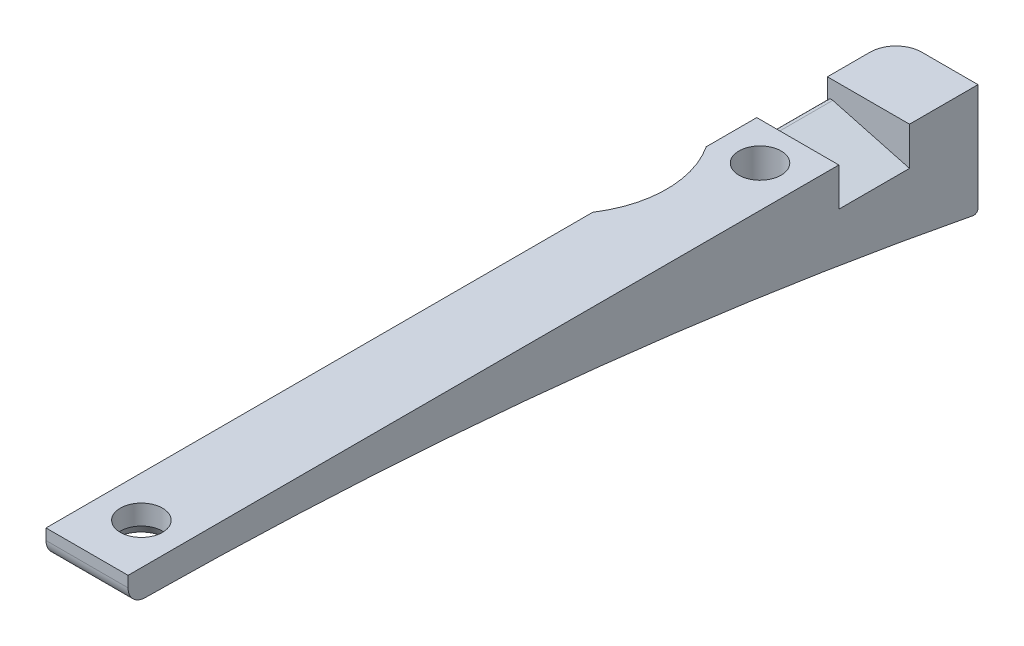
ISO-10303-21;
HEADER;
FILE_DESCRIPTION(('STEP AP214'),'2;1');
FILE_NAME('part.step','',(''),(''),'','','');
FILE_SCHEMA(('AUTOMOTIVE_DESIGN { 1 0 10303 214 1 1 1 1 }'));
ENDSEC;
DATA;
#1=APPLICATION_CONTEXT('core data for automotive mechanical design processes');
#2=APPLICATION_PROTOCOL_DEFINITION('international standard','automotive_design',2000,#1);
#3=PRODUCT_CONTEXT('',#1,'mechanical');
#4=PRODUCT('Part','Part','',(#3));
#5=PRODUCT_RELATED_PRODUCT_CATEGORY('part','',(#4));
#6=PRODUCT_DEFINITION_FORMATION('','',#4);
#7=PRODUCT_DEFINITION_CONTEXT('part definition',#1,'design');
#8=PRODUCT_DEFINITION('design','',#6,#7);
#9=PRODUCT_DEFINITION_SHAPE('','',#8);
#10=(LENGTH_UNIT() NAMED_UNIT(*) SI_UNIT(.MILLI.,.METRE.));
#11=(NAMED_UNIT(*) PLANE_ANGLE_UNIT() SI_UNIT($,.RADIAN.));
#12=(NAMED_UNIT(*) SI_UNIT($,.STERADIAN.) SOLID_ANGLE_UNIT());
#13=UNCERTAINTY_MEASURE_WITH_UNIT(LENGTH_MEASURE(1.E-05),#10,'distance_accuracy_value','');
#14=(GEOMETRIC_REPRESENTATION_CONTEXT(3) GLOBAL_UNCERTAINTY_ASSIGNED_CONTEXT((#13)) GLOBAL_UNIT_ASSIGNED_CONTEXT((#10,
#11,#12)) REPRESENTATION_CONTEXT('',''));
#15=CARTESIAN_POINT('',(0.,0.,0.));
#16=DIRECTION('',(0.,0.,1.));
#17=DIRECTION('',(1.,0.,0.));
#18=AXIS2_PLACEMENT_3D('',#15,#16,#17);
#19=CARTESIAN_POINT('',(3.8354,0.,0.));
#20=DIRECTION('',(0.,0.,1.));
#21=DIRECTION('',(0.,-1.,0.));
#22=AXIS2_PLACEMENT_3D('',#19,#20,#21);
#23=PLANE('',#22);
#24=DIRECTION('',(0.,1.,0.));
#25=VECTOR('',#24,1.);
#26=CARTESIAN_POINT('',(-1.4224,-10.3842799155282,0.));
#27=LINE('',#26,#25);
#28=CARTESIAN_POINT('',(-1.4224,-10.0032799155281,0.));
#29=VERTEX_POINT('',#28);
#30=CARTESIAN_POINT('',(-1.4224,0.,0.));
#31=VERTEX_POINT('',#30);
#32=EDGE_CURVE('E250',#29,#31,#27,.T.);
#33=ORIENTED_EDGE('',*,*,#32,.T.);
#34=DIRECTION('',(-1.,0.,0.));
#35=VECTOR('',#34,1.);
#36=CARTESIAN_POINT('',(3.8354,0.,0.));
#37=LINE('',#36,#35);
#38=CARTESIAN_POINT('',(3.8354,0.,0.));
#39=VERTEX_POINT('',#38);
#40=EDGE_CURVE('E162',#39,#31,#37,.T.);
#41=ORIENTED_EDGE('',*,*,#40,.F.);
#42=DIRECTION('',(0.,1.,0.));
#43=VECTOR('',#42,1.);
#44=CARTESIAN_POINT('',(3.8354,0.,0.));
#45=LINE('',#44,#43);
#46=CARTESIAN_POINT('',(3.8354,-10.0032799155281,0.));
#47=VERTEX_POINT('',#46);
#48=EDGE_CURVE('E153',#47,#39,#45,.T.);
#49=ORIENTED_EDGE('',*,*,#48,.F.);
#50=DIRECTION('',(-1.,0.,0.));
#51=VECTOR('',#50,1.);
#52=CARTESIAN_POINT('',(3.8354,-10.0032799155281,0.));
#53=LINE('',#52,#51);
#54=EDGE_CURVE('E165',#47,#29,#53,.T.);
#55=ORIENTED_EDGE('',*,*,#54,.T.);
#56=EDGE_LOOP('',(#33,#41,#49,#55));
#57=FACE_BOUND('',#56,.T.);
#58=ADVANCED_FACE('F34',(#57),#23,.F.);
#59=CARTESIAN_POINT('',(-3.8354,-10.0032799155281,0.380999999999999));
#60=DIRECTION('',(-1.,0.,0.));
#61=DIRECTION('',(0.,0.,1.));
#62=AXIS2_PLACEMENT_3D('',#59,#60,#61);
#63=PLANE('',#62);
#64=CARTESIAN_POINT('',(-3.8354,32.3492142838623,23.01875));
#65=DIRECTION('',(-1.,0.,0.));
#66=DIRECTION('',(0.,1.,0.));
#67=AXIS2_PLACEMENT_3D('',#64,#65,#66);
#68=ELLIPSE('',#67,38.2738449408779,9.906);
#69=CARTESIAN_POINT('',(-3.8354,0.,17.7245525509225));
#70=VERTEX_POINT('',#69);
#71=CARTESIAN_POINT('',(-3.8354,0.,28.3129474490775));
#72=VERTEX_POINT('',#71);
#73=EDGE_CURVE('E130',#70,#72,#68,.T.);
#74=ORIENTED_EDGE('',*,*,#73,.F.);
#75=DIRECTION('',(0.,0.,1.));
#76=VECTOR('',#75,1.);
#77=CARTESIAN_POINT('',(-3.8354,0.,79.4258));
#78=LINE('',#77,#76);
#79=CARTESIAN_POINT('',(-3.8354,0.,13.0048));
#80=VERTEX_POINT('',#79);
#81=EDGE_CURVE('E137',#80,#70,#78,.T.);
#82=ORIENTED_EDGE('',*,*,#81,.F.);
#83=DIRECTION('',(0.,1.,0.));
#84=VECTOR('',#83,1.);
#85=CARTESIAN_POINT('',(-3.8354,-1.524,13.0048));
#86=LINE('',#85,#84);
#87=CARTESIAN_POINT('',(-3.8354,-2.04121756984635,13.0048));
#88=VERTEX_POINT('',#87);
#89=EDGE_CURVE('E292',#88,#80,#86,.T.);
#90=ORIENTED_EDGE('',*,*,#89,.F.);
#91=DIRECTION('',(0.,0.,-1.));
#92=VECTOR('',#91,1.);
#93=CARTESIAN_POINT('',(-3.8354,-2.04121756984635,6.4008));
#94=LINE('',#93,#92);
#95=CARTESIAN_POINT('',(-3.8354,-2.04121756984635,6.4008));
#96=VERTEX_POINT('',#95);
#97=EDGE_CURVE('E180',#88,#96,#94,.T.);
#98=ORIENTED_EDGE('',*,*,#97,.T.);
#99=DIRECTION('',(0.,1.,0.));
#100=VECTOR('',#99,1.);
#101=CARTESIAN_POINT('',(-3.8354,-1.524,6.4008));
#102=LINE('',#101,#100);
#103=CARTESIAN_POINT('',(-3.8354,0.,6.4008));
#104=VERTEX_POINT('',#103);
#105=EDGE_CURVE('E299',#96,#104,#102,.T.);
#106=ORIENTED_EDGE('',*,*,#105,.T.);
#107=CARTESIAN_POINT('',(-3.8354,0.,2.413));
#108=VERTEX_POINT('',#107);
#109=EDGE_CURVE('E147',#108,#104,#78,.T.);
#110=ORIENTED_EDGE('',*,*,#109,.F.);
#111=DIRECTION('',(0.,1.,0.));
#112=VECTOR('',#111,1.);
#113=CARTESIAN_POINT('',(-3.8354,-10.3842799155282,2.413));
#114=LINE('',#113,#112);
#115=CARTESIAN_POINT('',(-3.8354,-10.0050872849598,2.41300000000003));
#116=VERTEX_POINT('',#115);
#117=EDGE_CURVE('E42',#108,#116,#114,.F.);
#118=ORIENTED_EDGE('',*,*,#117,.T.);
#119=CARTESIAN_POINT('',(-3.8354,-435.651560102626,82.2547502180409));
#120=DIRECTION('',(-1.,0.,0.));
#121=DIRECTION('',(0.,0.,-1.));
#122=AXIS2_PLACEMENT_3D('',#119,#120,#121);
#123=CIRCLE('',#122,433.07);
#124=CARTESIAN_POINT('',(-3.8354,-2.60391597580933,77.8544302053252));
#125=VERTEX_POINT('',#124);
#126=EDGE_CURVE('E158',#125,#116,#123,.T.);
#127=ORIENTED_EDGE('',*,*,#126,.F.);
#128=CARTESIAN_POINT('',(-3.8354,-1.01649792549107,77.8383));
#129=DIRECTION('',(1.,0.,0.));
#130=DIRECTION('',(0.,0.,-1.));
#131=AXIS2_PLACEMENT_3D('',#128,#129,#130);
#132=CIRCLE('',#131,1.58750000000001);
#133=CARTESIAN_POINT('',(-3.8354,-1.01649792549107,79.4258));
#134=VERTEX_POINT('',#133);
#135=EDGE_CURVE('E156',#134,#125,#132,.T.);
#136=ORIENTED_EDGE('',*,*,#135,.F.);
#137=DIRECTION('',(0.,-1.,0.));
#138=VECTOR('',#137,1.);
#139=CARTESIAN_POINT('',(-3.8354,-1.01649792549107,79.4258));
#140=LINE('',#139,#138);
#141=CARTESIAN_POINT('',(-3.8354,0.,79.4258));
#142=VERTEX_POINT('',#141);
#143=EDGE_CURVE('E149',#142,#134,#140,.T.);
#144=ORIENTED_EDGE('',*,*,#143,.F.);
#145=EDGE_CURVE('E139',#72,#142,#78,.T.);
#146=ORIENTED_EDGE('',*,*,#145,.F.);
#147=EDGE_LOOP('',(#74,#82,#90,#98,#106,#110,#118,#127,#136,#144,#146));
#148=FACE_BOUND('',#147,.T.);
#149=ADVANCED_FACE('F136',(#148),#63,.T.);
#150=CARTESIAN_POINT('',(3.8354,0.,79.4258));
#151=DIRECTION('',(0.,-1.,0.));
#152=DIRECTION('',(0.,0.,-1.));
#153=AXIS2_PLACEMENT_3D('',#150,#151,#152);
#154=PLANE('',#153);
#155=CARTESIAN_POINT('',(0.,0.,16.5354));
#156=DIRECTION('',(0.,1.,0.));
#157=DIRECTION('',(0.,0.,1.));
#158=AXIS2_PLACEMENT_3D('',#155,#156,#157);
#159=CIRCLE('',#158,1.9685);
#160=CARTESIAN_POINT('',(0.,0.,18.5039));
#161=VERTEX_POINT('',#160);
#162=EDGE_CURVE('E197',#161,#161,#159,.T.);
#163=ORIENTED_EDGE('',*,*,#162,.F.);
#164=EDGE_LOOP('',(#163));
#165=FACE_BOUND('',#164,.T.);
#166=CARTESIAN_POINT('',(-12.5033458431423,0.,23.01875));
#167=DIRECTION('',(0.,-1.,0.));
#168=DIRECTION('',(1.,0.,0.));
#169=AXIS2_PLACEMENT_3D('',#166,#167,#168);
#170=ELLIPSE('',#169,10.2554458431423,9.906);
#171=EDGE_CURVE('E11',#70,#72,#170,.T.);
#172=ORIENTED_EDGE('',*,*,#171,.T.);
#173=ORIENTED_EDGE('',*,*,#145,.T.);
#174=DIRECTION('',(-1.,0.,0.));
#175=VECTOR('',#174,1.);
#176=CARTESIAN_POINT('',(3.8354,0.,79.4258));
#177=LINE('',#176,#175);
#178=CARTESIAN_POINT('',(3.8354,0.,79.4258));
#179=VERTEX_POINT('',#178);
#180=EDGE_CURVE('E177',#179,#142,#177,.T.);
#181=ORIENTED_EDGE('',*,*,#180,.F.);
#182=DIRECTION('',(0.,0.,1.));
#183=VECTOR('',#182,1.);
#184=CARTESIAN_POINT('',(3.8354,0.,79.4258));
#185=LINE('',#184,#183);
#186=CARTESIAN_POINT('',(3.8354,0.,13.0048));
#187=VERTEX_POINT('',#186);
#188=EDGE_CURVE('E161',#187,#179,#185,.T.);
#189=ORIENTED_EDGE('',*,*,#188,.F.);
#190=DIRECTION('',(1.,0.,0.));
#191=VECTOR('',#190,1.);
#192=CARTESIAN_POINT('',(-3.8354,0.,13.0048));
#193=LINE('',#192,#191);
#194=EDGE_CURVE('E146',#80,#187,#193,.T.);
#195=ORIENTED_EDGE('',*,*,#194,.F.);
#196=ORIENTED_EDGE('',*,*,#81,.T.);
#197=EDGE_LOOP('',(#172,#173,#181,#189,#195,#196));
#198=FACE_BOUND('',#197,.T.);
#199=CARTESIAN_POINT('',(0.,0.,74.3458));
#200=DIRECTION('',(0.,1.,0.));
#201=DIRECTION('',(0.,0.,1.));
#202=AXIS2_PLACEMENT_3D('',#199,#200,#201);
#203=CIRCLE('',#202,1.9685);
#204=CARTESIAN_POINT('',(0.,0.,76.3143));
#205=VERTEX_POINT('',#204);
#206=EDGE_CURVE('E277',#205,#205,#203,.T.);
#207=ORIENTED_EDGE('',*,*,#206,.F.);
#208=EDGE_LOOP('',(#207));
#209=FACE_BOUND('',#208,.T.);
#210=ADVANCED_FACE('F143',(#165,#198,#209),#154,.F.);
#211=CARTESIAN_POINT('',(3.8354,-435.651560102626,82.2547502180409));
#212=DIRECTION('',(-1.,0.,0.));
#213=DIRECTION('',(0.,0.,1.));
#214=AXIS2_PLACEMENT_3D('',#211,#212,#213);
#215=CYLINDRICAL_SURFACE('',#214,433.07);
#216=CARTESIAN_POINT('',(-1.83030705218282,-7.88288744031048,14.7004195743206));
#217=CARTESIAN_POINT('',(-1.73429902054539,-7.90024416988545,14.5905131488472));
#218=CARTESIAN_POINT('',(-1.62823330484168,-7.91632053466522,14.4889903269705));
#219=CARTESIAN_POINT('',(-1.39925369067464,-7.94529982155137,14.3063253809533));
#220=CARTESIAN_POINT('',(-1.2763179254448,-7.95819856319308,14.2252101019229));
#221=CARTESIAN_POINT('',(-1.02604746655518,-7.97958886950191,14.0908723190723));
#222=CARTESIAN_POINT('',(-0.899523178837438,-7.98831308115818,14.0361751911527));
#223=CARTESIAN_POINT('',(-0.638927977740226,-8.00223569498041,13.9489510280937));
#224=CARTESIAN_POINT('',(-0.504861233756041,-8.00743602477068,13.9164118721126));
#225=CARTESIAN_POINT('',(-0.235235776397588,-8.01407906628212,13.8748543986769));
#226=CARTESIAN_POINT('',(-0.0997349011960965,-8.01558034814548,13.8654694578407));
#227=CARTESIAN_POINT('',(0.170930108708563,-8.01494396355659,13.8694488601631));
#228=CARTESIAN_POINT('',(0.306094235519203,-8.01280621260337,13.8828137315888));
#229=CARTESIAN_POINT('',(0.571375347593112,-8.00499050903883,13.9317159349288));
#230=CARTESIAN_POINT('',(0.701518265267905,-7.99933441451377,13.9671163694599));
#231=CARTESIAN_POINT('',(0.953992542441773,-7.98469425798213,14.0588639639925));
#232=CARTESIAN_POINT('',(1.07632381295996,-7.97571015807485,14.1152113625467));
#233=CARTESIAN_POINT('',(1.3105596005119,-7.95464593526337,14.2475520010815));
#234=CARTESIAN_POINT('',(1.42239491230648,-7.94254699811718,14.3236646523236));
#235=CARTESIAN_POINT('',(1.63178980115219,-7.91567086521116,14.4930995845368));
#236=CARTESIAN_POINT('',(1.72934839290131,-7.90089348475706,14.5864230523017));
#237=CARTESIAN_POINT('',(1.90904286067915,-7.86887208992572,14.7891485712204));
#238=CARTESIAN_POINT('',(1.99091851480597,-7.85159364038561,14.8987757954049));
#239=CARTESIAN_POINT('',(2.13525354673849,-7.81527133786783,15.129877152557));
#240=CARTESIAN_POINT('',(2.19771109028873,-7.79622731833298,15.2513524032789));
#241=CARTESIAN_POINT('',(2.30255660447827,-7.75658473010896,15.5049809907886));
#242=CARTESIAN_POINT('',(2.34457545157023,-7.73596483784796,15.6372836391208));
#243=CARTESIAN_POINT('',(2.40583213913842,-7.6940684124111,15.9069633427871));
#244=CARTESIAN_POINT('',(2.42506827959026,-7.67279183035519,16.0443407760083));
#245=CARTESIAN_POINT('',(2.4403562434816,-7.6299283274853,16.3219997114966));
#246=CARTESIAN_POINT('',(2.43613245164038,-7.60834070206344,16.4622963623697));
#247=CARTESIAN_POINT('',(2.40394855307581,-7.56571317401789,16.7402302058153));
#248=CARTESIAN_POINT('',(2.37598786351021,-7.54467328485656,16.8778673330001));
#249=CARTESIAN_POINT('',(2.29698510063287,-7.50370488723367,17.1467054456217));
#250=CARTESIAN_POINT('',(2.24591688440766,-7.48377766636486,17.2778989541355));
#251=CARTESIAN_POINT('',(2.12201735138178,-7.44561893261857,17.529846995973));
#252=CARTESIAN_POINT('',(2.04918689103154,-7.42738735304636,17.6506019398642));
#253=CARTESIAN_POINT('',(1.88452196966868,-7.39329999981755,17.8769547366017));
#254=CARTESIAN_POINT('',(1.79287693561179,-7.37742307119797,17.9826871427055));
#255=CARTESIAN_POINT('',(1.59267821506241,-7.34828591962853,18.1771417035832));
#256=CARTESIAN_POINT('',(1.4841259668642,-7.33502547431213,18.2658653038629));
#257=CARTESIAN_POINT('',(1.25502606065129,-7.31168751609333,18.4222770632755));
#258=CARTESIAN_POINT('',(1.13469477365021,-7.30156306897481,18.4902751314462));
#259=CARTESIAN_POINT('',(0.884067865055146,-7.28450448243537,18.6049745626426));
#260=CARTESIAN_POINT('',(0.753773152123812,-7.2775700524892,18.6516778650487));
#261=CARTESIAN_POINT('',(0.489023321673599,-7.26716918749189,18.7217684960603));
#262=CARTESIAN_POINT('',(0.354659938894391,-7.26365228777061,18.7454950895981));
#263=CARTESIAN_POINT('',(0.0838143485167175,-7.26000575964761,18.7700967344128));
#264=CARTESIAN_POINT('',(-0.0526677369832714,-7.2598759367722,18.7709730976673));
#265=CARTESIAN_POINT('',(-0.322714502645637,-7.26299417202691,18.7499347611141));
#266=CARTESIAN_POINT('',(-0.456293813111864,-7.26621509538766,18.7282031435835));
#267=CARTESIAN_POINT('',(-0.717877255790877,-7.27590324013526,18.66290650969));
#268=CARTESIAN_POINT('',(-0.845881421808,-7.28237044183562,18.619341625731));
#269=CARTESIAN_POINT('',(-1.09298991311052,-7.29838892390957,18.5116047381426));
#270=CARTESIAN_POINT('',(-1.21207613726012,-7.30794627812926,18.447392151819));
#271=CARTESIAN_POINT('',(-1.4378171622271,-7.32988108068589,18.3003157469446));
#272=CARTESIAN_POINT('',(-1.54447136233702,-7.34225866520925,18.2174510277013));
#273=CARTESIAN_POINT('',(-1.74361804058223,-7.36965445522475,18.0344822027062));
#274=CARTESIAN_POINT('',(-1.83594037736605,-7.38470041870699,17.9341971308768));
#275=CARTESIAN_POINT('',(-2.00256971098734,-7.41693378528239,17.7199422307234));
#276=CARTESIAN_POINT('',(-2.07687522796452,-7.43412136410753,17.6059712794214));
#277=CARTESIAN_POINT('',(-2.20661611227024,-7.47047187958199,17.3656481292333));
#278=CARTESIAN_POINT('',(-2.26173247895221,-7.48966189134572,17.2391278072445));
#279=CARTESIAN_POINT('',(-2.35004213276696,-7.52926669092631,16.9788426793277));
#280=CARTESIAN_POINT('',(-2.38323466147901,-7.54968152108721,16.8450776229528));
#281=CARTESIAN_POINT('',(-2.42719985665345,-7.59148472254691,16.572057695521));
#282=CARTESIAN_POINT('',(-2.43764661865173,-7.61288281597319,16.4327517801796));
#283=CARTESIAN_POINT('',(-2.43490346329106,-7.65578870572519,16.1543386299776));
#284=CARTESIAN_POINT('',(-2.42170509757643,-7.67729653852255,16.0152314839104));
#285=CARTESIAN_POINT('',(-2.37183122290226,-7.71995762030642,15.7401802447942));
#286=CARTESIAN_POINT('',(-2.3349866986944,-7.74110718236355,15.6042662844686));
#287=CARTESIAN_POINT('',(-2.23864252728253,-7.78224472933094,15.3406887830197));
#288=CARTESIAN_POINT('',(-2.17917640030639,-7.80223438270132,15.2130133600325));
#289=CARTESIAN_POINT('',(-2.06933523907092,-7.83223717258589,15.0218950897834));
#290=CARTESIAN_POINT('',(-2.02601203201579,-7.84285000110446,14.9544023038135));
#291=CARTESIAN_POINT('',(-1.9329105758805,-7.86340031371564,14.823899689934));
#292=CARTESIAN_POINT('',(-1.88313117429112,-7.87333767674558,14.7608906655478));
#293=CARTESIAN_POINT('',(-1.83030705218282,-7.88288744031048,14.7004195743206));
#294=B_SPLINE_CURVE_WITH_KNOTS('',3,(#216,#217,#218,#219,#220,#221,#222,#223,#224,#225,#226,
#227,#228,#229,#230,#231,#232,#233,#234,#235,#236,#237,#238,#239,#240,#241,#242,#243,#244,#245,
#246,#247,#248,#249,#250,#251,#252,#253,#254,#255,#256,#257,#258,#259,#260,#261,#262,#263,#264,
#265,#266,#267,#268,#269,#270,#271,#272,#273,#274,#275,#276,#277,#278,#279,#280,#281,#282,#283,
#284,#285,#286,#287,#288,#289,#290,#291,#292,#293),.UNSPECIFIED.,.T.,.F.,(4,2,2,2,2,2,2,2,2,2,2,
2,2,2,2,2,2,2,2,2,2,2,2,2,2,2,2,2,2,2,2,2,2,2,2,2,2,2,4),(0.,0.440555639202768,
0.881687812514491,1.29403677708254,1.70615999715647,2.1117145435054,2.51727850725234,
2.92034768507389,3.32342145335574,3.72898945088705,4.13458542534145,4.54641822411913,
4.95828991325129,5.37734674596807,5.7964348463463,6.2204568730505,6.64448931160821,
7.06900268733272,7.49349935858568,7.91391510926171,8.33429511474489,8.74804007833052,
9.16174735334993,9.5692483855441,9.97672602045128,10.3809293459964,10.7851302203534,
11.1901304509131,11.5951502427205,12.0046609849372,12.4142053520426,12.8302649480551,
13.2463389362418,13.6683363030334,14.0904844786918,14.5156841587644,14.9402562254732,
15.1826089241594,15.4250049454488),.UNSPECIFIED.);
#295=CARTESIAN_POINT('',(-1.83030705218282,-7.88288744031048,14.7004195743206));
#296=VERTEX_POINT('',#295);
#297=EDGE_CURVE('E189',#296,#296,#294,.T.);
#298=ORIENTED_EDGE('',*,*,#297,.F.);
#299=EDGE_LOOP('',(#298));
#300=FACE_BOUND('',#299,.T.);
#301=ORIENTED_EDGE('',*,*,#126,.T.);
#302=CARTESIAN_POINT('',(-3.8354,-10.0050872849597,2.413));
#303=CARTESIAN_POINT('',(-3.83539872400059,-10.0179935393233,2.34419462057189));
#304=CARTESIAN_POINT('',(-3.8324552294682,-10.0309104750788,2.27542549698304));
#305=CARTESIAN_POINT('',(-3.82070944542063,-10.0566860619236,2.13837897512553));
#306=CARTESIAN_POINT('',(-3.81190718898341,-10.0695447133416,2.07010157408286));
#307=CARTESIAN_POINT('',(-3.7767761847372,-10.1078861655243,1.86678215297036));
#308=CARTESIAN_POINT('',(-3.74172307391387,-10.1331628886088,1.73310140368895));
#309=CARTESIAN_POINT('',(-3.64922984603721,-10.1823882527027,1.47340185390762));
#310=CARTESIAN_POINT('',(-3.59176928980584,-10.2063356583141,1.34739017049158));
#311=CARTESIAN_POINT('',(-3.45599463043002,-10.2521549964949,1.10682350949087));
#312=CARTESIAN_POINT('',(-3.3777005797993,-10.274028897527,0.992257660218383));
#313=CARTESIAN_POINT('',(-3.22340416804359,-10.3101114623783,0.803636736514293));
#314=CARTESIAN_POINT('',(-3.15132969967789,-10.3249023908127,0.726445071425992));
#315=CARTESIAN_POINT('',(-2.99752561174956,-10.3526238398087,0.581957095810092));
#316=CARTESIAN_POINT('',(-2.91579415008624,-10.3655540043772,0.514662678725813));
#317=CARTESIAN_POINT('',(-2.82982218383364,-10.3774213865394,0.452966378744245));
#318=B_SPLINE_CURVE_WITH_KNOTS('',3,(#302,#303,#304,#305,#306,#307,#308,#309,#310,#311,#312,
#313,#314,#315,#316,#317),.UNSPECIFIED.,.F.,.F.,(4,2,2,2,2,2,2,4),(0.,0.209887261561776,
0.419773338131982,0.839088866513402,1.25878777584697,1.67808417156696,1.99712849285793,
2.31623377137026),.UNSPECIFIED.);
#319=CARTESIAN_POINT('',(-2.8298221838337,-10.3774213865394,0.452966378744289));
#320=VERTEX_POINT('',#319);
#321=EDGE_CURVE('E49',#116,#320,#318,.T.);
#322=ORIENTED_EDGE('',*,*,#321,.T.);
#323=DIRECTION('',(-1.,0.,0.));
#324=VECTOR('',#323,1.);
#325=CARTESIAN_POINT('',(3.8354,-10.3774213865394,0.452966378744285));
#326=LINE('',#325,#324);
#327=CARTESIAN_POINT('',(3.8354,-10.3774213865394,0.452966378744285));
#328=VERTEX_POINT('',#327);
#329=EDGE_CURVE('E168',#328,#320,#326,.T.);
#330=ORIENTED_EDGE('',*,*,#329,.F.);
#331=CARTESIAN_POINT('',(3.8354,-435.651560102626,82.2547502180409));
#332=DIRECTION('',(-1.,0.,0.));
#333=DIRECTION('',(0.,0.,-1.));
#334=AXIS2_PLACEMENT_3D('',#331,#332,#333);
#335=CIRCLE('',#334,433.07);
#336=CARTESIAN_POINT('',(3.8354,-2.60391597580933,77.8544302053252));
#337=VERTEX_POINT('',#336);
#338=EDGE_CURVE('E312',#337,#328,#335,.T.);
#339=ORIENTED_EDGE('',*,*,#338,.F.);
#340=DIRECTION('',(-1.,0.,0.));
#341=VECTOR('',#340,1.);
#342=CARTESIAN_POINT('',(3.8354,-2.60391597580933,77.8544302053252));
#343=LINE('',#342,#341);
#344=EDGE_CURVE('E171',#337,#125,#343,.T.);
#345=ORIENTED_EDGE('',*,*,#344,.T.);
#346=EDGE_LOOP('',(#301,#322,#330,#339,#345));
#347=FACE_BOUND('',#346,.T.);
#348=CARTESIAN_POINT('',(-1.72610727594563,-2.6889432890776,72.6112372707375));
#349=CARTESIAN_POINT('',(-1.62884396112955,-2.69113873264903,72.5126690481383));
#350=CARTESIAN_POINT('',(-1.52305265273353,-2.69318402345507,72.4223574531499));
#351=CARTESIAN_POINT('',(-1.29751921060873,-2.69687792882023,72.2610201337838));
#352=CARTESIAN_POINT('',(-1.17775978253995,-2.69852604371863,72.1900186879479));
#353=CARTESIAN_POINT('',(-0.92987102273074,-2.70132187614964,72.0704658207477));
#354=CARTESIAN_POINT('',(-0.801906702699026,-2.70247719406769,72.0215726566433));
#355=CARTESIAN_POINT('',(-0.53961636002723,-2.70426967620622,71.9460134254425));
#356=CARTESIAN_POINT('',(-0.40529234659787,-2.70490700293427,71.9193403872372));
#357=CARTESIAN_POINT('',(-0.134269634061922,-2.70563272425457,71.8889844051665));
#358=CARTESIAN_POINT('',(0.0024252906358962,-2.70572192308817,71.885267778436));
#359=CARTESIAN_POINT('',(0.274503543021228,-2.70534917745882,71.9008425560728));
#360=CARTESIAN_POINT('',(0.409886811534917,-2.70488720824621,71.9201349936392));
#361=CARTESIAN_POINT('',(0.675420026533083,-2.70343487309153,71.9811587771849));
#362=CARTESIAN_POINT('',(0.805572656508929,-2.70244478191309,72.0228784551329));
#363=CARTESIAN_POINT('',(1.05703255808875,-2.69998371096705,72.1275529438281));
#364=CARTESIAN_POINT('',(1.17833983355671,-2.69851273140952,72.1905077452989));
#365=CARTESIAN_POINT('',(1.40877990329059,-2.69515713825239,72.3359143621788));
#366=CARTESIAN_POINT('',(1.51790241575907,-2.69327217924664,72.4183824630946));
#367=CARTESIAN_POINT('',(1.72078014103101,-2.68917447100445,72.6004353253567));
#368=CARTESIAN_POINT('',(1.81453524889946,-2.68696171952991,72.700020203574));
#369=CARTESIAN_POINT('',(1.98419352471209,-2.68229971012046,72.9136651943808));
#370=CARTESIAN_POINT('',(2.06006521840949,-2.67985004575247,73.0277502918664));
#371=CARTESIAN_POINT('',(2.19161508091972,-2.67481718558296,73.267020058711));
#372=CARTESIAN_POINT('',(2.2472930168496,-2.67223398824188,73.3922048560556));
#373=CARTESIAN_POINT('',(2.33697679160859,-2.66702672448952,73.6503653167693));
#374=CARTESIAN_POINT('',(2.37094310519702,-2.66440259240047,73.7833547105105));
#375=CARTESIAN_POINT('',(2.41608936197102,-2.65920819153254,74.0531477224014));
#376=CARTESIAN_POINT('',(2.42726915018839,-2.6566379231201,74.189951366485));
#377=CARTESIAN_POINT('',(2.42652688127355,-2.65162668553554,74.4636454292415));
#378=CARTESIAN_POINT('',(2.41458010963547,-2.64918585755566,74.6005357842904));
#379=CARTESIAN_POINT('',(2.36786917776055,-2.64450005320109,74.8703705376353));
#380=CARTESIAN_POINT('',(2.33310498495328,-2.64225507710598,75.0033149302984));
#381=CARTESIAN_POINT('',(2.24173963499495,-2.638008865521,75.2614661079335));
#382=CARTESIAN_POINT('',(2.18514055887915,-2.63600760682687,75.3866736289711));
#383=CARTESIAN_POINT('',(2.05169927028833,-2.63228085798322,75.6257970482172));
#384=CARTESIAN_POINT('',(1.97485715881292,-2.63055536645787,75.7397130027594));
#385=CARTESIAN_POINT('',(1.80320124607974,-2.62740069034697,75.9528745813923));
#386=CARTESIAN_POINT('',(1.70840829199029,-2.62597116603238,76.0521369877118));
#387=CARTESIAN_POINT('',(1.50347638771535,-2.62341394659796,76.2333079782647));
#388=CARTESIAN_POINT('',(1.39333757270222,-2.62228624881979,76.3152167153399));
#389=CARTESIAN_POINT('',(1.16103965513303,-2.62033515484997,76.4592074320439));
#390=CARTESIAN_POINT('',(1.03890117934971,-2.61951124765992,76.5213226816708));
#391=CARTESIAN_POINT('',(0.785917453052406,-2.6181621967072,76.6241323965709));
#392=CARTESIAN_POINT('',(0.655072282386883,-2.61763705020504,76.6648270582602));
#393=CARTESIAN_POINT('',(0.388602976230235,-2.6168825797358,76.7235809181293));
#394=CARTESIAN_POINT('',(0.252986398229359,-2.61665280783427,76.7416743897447));
#395=CARTESIAN_POINT('',(-0.019358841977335,-2.6164856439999,76.7548198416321));
#396=CARTESIAN_POINT('',(-0.156087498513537,-2.61654825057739,76.7498719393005));
#397=CARTESIAN_POINT('',(-0.426670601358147,-2.61696625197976,76.7170890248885));
#398=CARTESIAN_POINT('',(-0.560527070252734,-2.6173214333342,76.6892706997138));
#399=CARTESIAN_POINT('',(-0.821671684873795,-2.61832711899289,76.6115659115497));
#400=CARTESIAN_POINT('',(-0.94895983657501,-2.61897762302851,76.5616794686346));
#401=CARTESIAN_POINT('',(-1.19340691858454,-2.62057776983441,76.4412443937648));
#402=CARTESIAN_POINT('',(-1.31056227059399,-2.62152751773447,76.3706885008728));
#403=CARTESIAN_POINT('',(-1.53138381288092,-2.62372778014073,76.2109356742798));
#404=CARTESIAN_POINT('',(-1.63504990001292,-2.62497829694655,76.1217385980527));
#405=CARTESIAN_POINT('',(-1.82609618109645,-2.62777852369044,75.9271165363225));
#406=CARTESIAN_POINT('',(-1.91345522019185,-2.62932861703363,75.8216707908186));
#407=CARTESIAN_POINT('',(-2.06926488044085,-2.63271498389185,75.5976335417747));
#408=CARTESIAN_POINT('',(-2.13771528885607,-2.63455126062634,75.479041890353));
#409=CARTESIAN_POINT('',(-2.2538889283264,-2.63848962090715,75.2318605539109));
#410=CARTESIAN_POINT('',(-2.30157614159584,-2.64059215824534,75.1032539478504));
#411=CARTESIAN_POINT('',(-2.37471247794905,-2.64502220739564,74.8398749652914));
#412=CARTESIAN_POINT('',(-2.40016232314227,-2.64734971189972,74.7051027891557));
#413=CARTESIAN_POINT('',(-2.42813511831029,-2.65217900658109,74.4330238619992));
#414=CARTESIAN_POINT('',(-2.43062785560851,-2.65468102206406,74.2957140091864));
#415=CARTESIAN_POINT('',(-2.41253356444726,-2.65978763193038,74.0225855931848));
#416=CARTESIAN_POINT('',(-2.39194041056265,-2.6623922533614,73.8867674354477));
#417=CARTESIAN_POINT('',(-2.32822247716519,-2.66762217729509,73.6203897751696));
#418=CARTESIAN_POINT('',(-2.28507463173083,-2.67024749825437,73.4898358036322));
#419=CARTESIAN_POINT('',(-2.17747415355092,-2.67541967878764,73.2379564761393));
#420=CARTESIAN_POINT('',(-2.11304849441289,-2.67796663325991,73.1166196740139));
#421=CARTESIAN_POINT('',(-1.99369501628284,-2.68192482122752,72.9314035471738));
#422=CARTESIAN_POINT('',(-1.94482984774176,-2.68339226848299,72.8635416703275));
#423=CARTESIAN_POINT('',(-1.8403807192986,-2.68623913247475,72.733196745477));
#424=CARTESIAN_POINT('',(-1.78479651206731,-2.68761854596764,72.6707138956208));
#425=CARTESIAN_POINT('',(-1.72610727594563,-2.6889432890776,72.6112372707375));
#426=B_SPLINE_CURVE_WITH_KNOTS('',3,(#348,#349,#350,#351,#352,#353,#354,#355,#356,#357,#358,
#359,#360,#361,#362,#363,#364,#365,#366,#367,#368,#369,#370,#371,#372,#373,#374,#375,#376,#377,
#378,#379,#380,#381,#382,#383,#384,#385,#386,#387,#388,#389,#390,#391,#392,#393,#394,#395,#396,
#397,#398,#399,#400,#401,#402,#403,#404,#405,#406,#407,#408,#409,#410,#411,#412,#413,#414,#415,
#416,#417,#418,#419,#420,#421,#422,#423,#424,#425),.UNSPECIFIED.,.T.,.F.,(4,2,2,2,2,2,2,2,2,2,2,
2,2,2,2,2,2,2,2,2,2,2,2,2,2,2,2,2,2,2,2,2,2,2,2,2,2,2,4),(0.,0.415168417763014,
0.830856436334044,1.23987863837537,1.64877246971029,2.05706620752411,2.46537828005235,
2.87347812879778,3.2815777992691,3.69001927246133,4.09846353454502,4.50762136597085,
4.91678391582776,5.32668922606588,5.73659732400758,6.14694371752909,6.55729069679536,
6.96759857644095,7.37790440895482,7.78773662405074,8.1975652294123,8.60670129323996,
9.01583360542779,9.42434473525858,9.8328537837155,10.2410650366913,10.6492759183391,
11.0576303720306,11.4659879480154,11.8748716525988,12.2837599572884,12.6933547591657,
13.1029362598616,13.5130567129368,13.9232860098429,14.3339356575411,14.7440667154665,
14.9945724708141,15.2450874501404),.UNSPECIFIED.);
#427=CARTESIAN_POINT('',(-1.72610727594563,-2.6889432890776,72.6112372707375));
#428=VERTEX_POINT('',#427);
#429=EDGE_CURVE('E198',#428,#428,#426,.T.);
#430=ORIENTED_EDGE('',*,*,#429,.F.);
#431=EDGE_LOOP('',(#430));
#432=FACE_BOUND('',#431,.T.);
#433=ADVANCED_FACE('F202',(#300,#347,#432),#215,.F.);
#434=ORIENTED_EDGE('',*,*,#40,.T.);
#435=CARTESIAN_POINT('',(-1.4224,0.,2.413));
#436=DIRECTION('',(0.,-1.,0.));
#437=DIRECTION('',(0.,0.,-1.));
#438=AXIS2_PLACEMENT_3D('',#435,#436,#437);
#439=CIRCLE('',#438,2.413);
#440=EDGE_CURVE('E140',#108,#31,#439,.T.);
#441=ORIENTED_EDGE('',*,*,#440,.F.);
#442=ORIENTED_EDGE('',*,*,#109,.T.);
#443=DIRECTION('',(1.,0.,0.));
#444=VECTOR('',#443,1.);
#445=CARTESIAN_POINT('',(-3.8354,0.,6.4008));
#446=LINE('',#445,#444);
#447=CARTESIAN_POINT('',(3.8354,0.,6.4008));
#448=VERTEX_POINT('',#447);
#449=EDGE_CURVE('E290',#104,#448,#446,.T.);
#450=ORIENTED_EDGE('',*,*,#449,.T.);
#451=EDGE_CURVE('E305',#39,#448,#185,.T.);
#452=ORIENTED_EDGE('',*,*,#451,.F.);
#453=EDGE_LOOP('',(#434,#441,#442,#450,#452));
#454=FACE_BOUND('',#453,.T.);
#455=ADVANCED_FACE('F324',(#454),#154,.F.);
#456=CARTESIAN_POINT('',(3.8354,-1.01649792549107,79.4258));
#457=DIRECTION('',(0.,0.,-1.));
#458=DIRECTION('',(-1.,0.,0.));
#459=AXIS2_PLACEMENT_3D('',#456,#457,#458);
#460=PLANE('',#459);
#461=ORIENTED_EDGE('',*,*,#143,.T.);
#462=DIRECTION('',(-1.,0.,0.));
#463=VECTOR('',#462,1.);
#464=CARTESIAN_POINT('',(3.8354,-1.01649792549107,79.4258));
#465=LINE('',#464,#463);
#466=CARTESIAN_POINT('',(3.8354,-1.01649792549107,79.4258));
#467=VERTEX_POINT('',#466);
#468=EDGE_CURVE('E174',#467,#134,#465,.T.);
#469=ORIENTED_EDGE('',*,*,#468,.F.);
#470=DIRECTION('',(0.,-1.,0.));
#471=VECTOR('',#470,1.);
#472=CARTESIAN_POINT('',(3.8354,-1.01649792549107,79.4258));
#473=LINE('',#472,#471);
#474=EDGE_CURVE('E308',#179,#467,#473,.T.);
#475=ORIENTED_EDGE('',*,*,#474,.F.);
#476=ORIENTED_EDGE('',*,*,#180,.T.);
#477=EDGE_LOOP('',(#461,#469,#475,#476));
#478=FACE_BOUND('',#477,.T.);
#479=ADVANCED_FACE('F336',(#478),#460,.F.);
#480=CARTESIAN_POINT('',(3.8354,-1.01649792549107,77.8383));
#481=DIRECTION('',(-1.,0.,0.));
#482=DIRECTION('',(0.,0.,1.));
#483=AXIS2_PLACEMENT_3D('',#480,#481,#482);
#484=CYLINDRICAL_SURFACE('',#483,1.58750000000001);
#485=ORIENTED_EDGE('',*,*,#135,.T.);
#486=ORIENTED_EDGE('',*,*,#344,.F.);
#487=CARTESIAN_POINT('',(3.8354,-1.01649792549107,77.8383));
#488=DIRECTION('',(1.,0.,0.));
#489=DIRECTION('',(0.,0.,-1.));
#490=AXIS2_PLACEMENT_3D('',#487,#488,#489);
#491=CIRCLE('',#490,1.58750000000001);
#492=EDGE_CURVE('E310',#467,#337,#491,.T.);
#493=ORIENTED_EDGE('',*,*,#492,.F.);
#494=ORIENTED_EDGE('',*,*,#468,.T.);
#495=EDGE_LOOP('',(#485,#486,#493,#494));
#496=FACE_BOUND('',#495,.T.);
#497=ADVANCED_FACE('F240',(#496),#484,.T.);
#498=CARTESIAN_POINT('',(3.8354,-10.0032799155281,0.380999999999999));
#499=DIRECTION('',(-1.,0.,0.));
#500=DIRECTION('',(0.,0.,1.));
#501=AXIS2_PLACEMENT_3D('',#498,#499,#500);
#502=CYLINDRICAL_SURFACE('',#501,0.381000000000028);
#503=ORIENTED_EDGE('',*,*,#329,.T.);
#504=CARTESIAN_POINT('',(-2.8298221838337,-10.3774213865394,0.452966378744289));
#505=CARTESIAN_POINT('',(-2.80503049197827,-10.3808288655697,0.435158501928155));
#506=CARTESIAN_POINT('',(-2.77980071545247,-10.3828770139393,0.417760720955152));
#507=CARTESIAN_POINT('',(-2.72868798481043,-10.3846482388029,0.383933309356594));
#508=CARTESIAN_POINT('',(-2.70280644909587,-10.3843759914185,0.367501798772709));
#509=CARTESIAN_POINT('',(-2.65072237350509,-10.381920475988,0.335810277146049));
#510=CARTESIAN_POINT('',(-2.6245240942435,-10.3797526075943,0.320541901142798));
#511=CARTESIAN_POINT('',(-2.57169703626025,-10.3738188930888,0.291066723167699));
#512=CARTESIAN_POINT('',(-2.54506797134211,-10.3700519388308,0.276860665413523));
#513=CARTESIAN_POINT('',(-2.47173037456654,-10.3579002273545,0.239477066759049));
#514=CARTESIAN_POINT('',(-2.42468090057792,-10.3481579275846,0.217399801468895));
#515=CARTESIAN_POINT('',(-2.32989533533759,-10.3256246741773,0.176554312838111));
#516=CARTESIAN_POINT('',(-2.28215893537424,-10.3128323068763,0.15778763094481));
#517=CARTESIAN_POINT('',(-2.13770974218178,-10.2708908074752,0.106186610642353));
#518=CARTESIAN_POINT('',(-2.04021060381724,-10.2382676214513,0.0782797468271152));
#519=CARTESIAN_POINT('',(-1.85748704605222,-10.1728490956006,0.0379581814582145));
#520=CARTESIAN_POINT('',(-1.77236712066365,-10.1406617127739,0.0239694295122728));
#521=CARTESIAN_POINT('',(-1.60198881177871,-10.0746160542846,0.00517257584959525));
#522=CARTESIAN_POINT('',(-1.51673143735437,-10.0407625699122,0.000339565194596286));
#523=CARTESIAN_POINT('',(-1.42848664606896,-10.005698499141,5.76038582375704E-06));
#524=CARTESIAN_POINT('',(-1.4254432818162,-10.0044891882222,3.41110593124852E-09));
#525=CARTESIAN_POINT('',(-1.4224,-10.0032799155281,0.));
#526=B_SPLINE_CURVE_WITH_KNOTS('',3,(#504,#505,#506,#507,#508,#509,#510,#511,#512,#513,#514,
#515,#516,#517,#518,#519,#520,#521,#522,#523,#524,#525),.UNSPECIFIED.,.F.,.F.,(4,2,2,2,2,2,2,2,
2,2,4),(0.,0.0920561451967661,0.183926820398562,0.275058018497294,0.366252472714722,
0.524626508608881,0.683074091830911,1.0014999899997,1.27728874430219,1.55232610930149,
1.56215058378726),.UNSPECIFIED.);
#527=EDGE_CURVE('E243',#320,#29,#526,.T.);
#528=ORIENTED_EDGE('',*,*,#527,.T.);
#529=ORIENTED_EDGE('',*,*,#54,.F.);
#530=CARTESIAN_POINT('',(3.8354,-10.0032799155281,0.380999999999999));
#531=DIRECTION('',(1.,0.,0.));
#532=DIRECTION('',(0.,0.,1.));
#533=AXIS2_PLACEMENT_3D('',#530,#531,#532);
#534=CIRCLE('',#533,0.381000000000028);
#535=EDGE_CURVE('E313',#328,#47,#534,.T.);
#536=ORIENTED_EDGE('',*,*,#535,.F.);
#537=EDGE_LOOP('',(#503,#528,#529,#536));
#538=FACE_BOUND('',#537,.T.);
#539=ADVANCED_FACE('F232',(#538),#502,.T.);
#540=CARTESIAN_POINT('',(3.8354,-10.0032799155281,0.380999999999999));
#541=DIRECTION('',(-1.,0.,0.));
#542=DIRECTION('',(0.,0.,1.));
#543=AXIS2_PLACEMENT_3D('',#540,#541,#542);
#544=PLANE('',#543);
#545=DIRECTION('',(0.,0.,-1.));
#546=VECTOR('',#545,1.);
#547=CARTESIAN_POINT('',(3.8354,-3.5793846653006,13.0048));
#548=LINE('',#547,#546);
#549=CARTESIAN_POINT('',(3.8354,-3.5793846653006,13.0048));
#550=VERTEX_POINT('',#549);
#551=CARTESIAN_POINT('',(3.8354,-3.5793846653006,6.4008));
#552=VERTEX_POINT('',#551);
#553=EDGE_CURVE('E150',#550,#552,#548,.T.);
#554=ORIENTED_EDGE('',*,*,#553,.F.);
#555=DIRECTION('',(0.,-1.,0.));
#556=VECTOR('',#555,1.);
#557=CARTESIAN_POINT('',(3.8354,0.,13.0048));
#558=LINE('',#557,#556);
#559=EDGE_CURVE('E286',#187,#550,#558,.T.);
#560=ORIENTED_EDGE('',*,*,#559,.F.);
#561=ORIENTED_EDGE('',*,*,#188,.T.);
#562=ORIENTED_EDGE('',*,*,#474,.T.);
#563=ORIENTED_EDGE('',*,*,#492,.T.);
#564=ORIENTED_EDGE('',*,*,#338,.T.);
#565=ORIENTED_EDGE('',*,*,#535,.T.);
#566=ORIENTED_EDGE('',*,*,#48,.T.);
#567=ORIENTED_EDGE('',*,*,#451,.T.);
#568=DIRECTION('',(0.,-1.,0.));
#569=VECTOR('',#568,1.);
#570=CARTESIAN_POINT('',(3.8354,0.,6.4008));
#571=LINE('',#570,#569);
#572=EDGE_CURVE('E196',#448,#552,#571,.T.);
#573=ORIENTED_EDGE('',*,*,#572,.T.);
#574=EDGE_LOOP('',(#554,#560,#561,#562,#563,#564,#565,#566,#567,#573));
#575=FACE_BOUND('',#574,.T.);
#576=ADVANCED_FACE('F229',(#575),#544,.F.);
#577=CARTESIAN_POINT('',(3.8354,-3.5793846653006,13.0048));
#578=DIRECTION('',(-0.258819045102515,-0.96592582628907,0.));
#579=DIRECTION('',(0.96592582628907,-0.258819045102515,0.));
#580=AXIS2_PLACEMENT_3D('',#577,#578,#579);
#581=PLANE('',#580);
#582=DIRECTION('',(-0.96592582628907,0.258819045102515,0.));
#583=VECTOR('',#582,1.);
#584=CARTESIAN_POINT('',(3.8354,-3.5793846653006,6.4008));
#585=LINE('',#584,#583);
#586=CARTESIAN_POINT('',(-3.33580619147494,-1.65786575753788,6.4008));
#587=VERTEX_POINT('',#586);
#588=EDGE_CURVE('E297',#552,#587,#585,.T.);
#589=ORIENTED_EDGE('',*,*,#588,.T.);
#590=DIRECTION('',(0.,0.,-1.));
#591=VECTOR('',#590,1.);
#592=CARTESIAN_POINT('',(-3.33580619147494,-1.65786575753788,13.0048));
#593=LINE('',#592,#591);
#594=CARTESIAN_POINT('',(-3.33580619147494,-1.65786575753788,13.0048));
#595=VERTEX_POINT('',#594);
#596=EDGE_CURVE('E57',#587,#595,#593,.F.);
#597=ORIENTED_EDGE('',*,*,#596,.T.);
#598=DIRECTION('',(-0.96592582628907,0.258819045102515,0.));
#599=VECTOR('',#598,1.);
#600=CARTESIAN_POINT('',(3.8354,-3.5793846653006,13.0048));
#601=LINE('',#600,#599);
#602=EDGE_CURVE('E289',#550,#595,#601,.T.);
#603=ORIENTED_EDGE('',*,*,#602,.F.);
#604=ORIENTED_EDGE('',*,*,#553,.T.);
#605=EDGE_LOOP('',(#589,#597,#603,#604));
#606=FACE_BOUND('',#605,.T.);
#607=ADVANCED_FACE('F222',(#606),#581,.F.);
#608=CARTESIAN_POINT('',(0.,0.,13.0048));
#609=DIRECTION('',(0.,0.,1.));
#610=DIRECTION('',(0.,-1.,0.));
#611=AXIS2_PLACEMENT_3D('',#608,#609,#610);
#612=PLANE('',#611);
#613=ORIENTED_EDGE('',*,*,#559,.T.);
#614=ORIENTED_EDGE('',*,*,#602,.T.);
#615=CARTESIAN_POINT('',(-3.438525,-2.04121756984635,13.0048));
#616=DIRECTION('',(0.,0.,1.));
#617=DIRECTION('',(0.,-1.,0.));
#618=AXIS2_PLACEMENT_3D('',#615,#616,#617);
#619=CIRCLE('',#618,0.396875);
#620=EDGE_CURVE('E186',#595,#88,#619,.T.);
#621=ORIENTED_EDGE('',*,*,#620,.T.);
#622=ORIENTED_EDGE('',*,*,#89,.T.);
#623=ORIENTED_EDGE('',*,*,#194,.T.);
#624=EDGE_LOOP('',(#613,#614,#621,#622,#623));
#625=FACE_BOUND('',#624,.T.);
#626=ADVANCED_FACE('F218',(#625),#612,.F.);
#627=CARTESIAN_POINT('',(0.,0.,6.4008));
#628=DIRECTION('',(0.,0.,1.));
#629=DIRECTION('',(0.,-1.,0.));
#630=AXIS2_PLACEMENT_3D('',#627,#628,#629);
#631=PLANE('',#630);
#632=ORIENTED_EDGE('',*,*,#572,.F.);
#633=ORIENTED_EDGE('',*,*,#449,.F.);
#634=ORIENTED_EDGE('',*,*,#105,.F.);
#635=CARTESIAN_POINT('',(-3.438525,-2.04121756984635,6.4008));
#636=DIRECTION('',(0.,0.,1.));
#637=DIRECTION('',(0.,-1.,0.));
#638=AXIS2_PLACEMENT_3D('',#635,#636,#637);
#639=CIRCLE('',#638,0.396875);
#640=EDGE_CURVE('E184',#96,#587,#639,.F.);
#641=ORIENTED_EDGE('',*,*,#640,.T.);
#642=ORIENTED_EDGE('',*,*,#588,.F.);
#643=EDGE_LOOP('',(#632,#633,#634,#641,#642));
#644=FACE_BOUND('',#643,.T.);
#645=ADVANCED_FACE('F221',(#644),#631,.T.);
#646=CARTESIAN_POINT('',(-3.438525,-2.04121756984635,0.381));
#647=DIRECTION('',(0.,0.,1.));
#648=DIRECTION('',(0.,-1.,0.));
#649=AXIS2_PLACEMENT_3D('',#646,#647,#648);
#650=CYLINDRICAL_SURFACE('',#649,0.396875);
#651=ORIENTED_EDGE('',*,*,#620,.F.);
#652=ORIENTED_EDGE('',*,*,#596,.F.);
#653=ORIENTED_EDGE('',*,*,#640,.F.);
#654=ORIENTED_EDGE('',*,*,#97,.F.);
#655=EDGE_LOOP('',(#651,#652,#653,#654));
#656=FACE_BOUND('',#655,.T.);
#657=ADVANCED_FACE('F36',(#656),#650,.T.);
#658=CARTESIAN_POINT('',(0.,-8.01530399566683,16.5354));
#659=DIRECTION('',(0.,-1.,0.));
#660=DIRECTION('',(0.,0.,-1.));
#661=AXIS2_PLACEMENT_3D('',#658,#659,#660);
#662=CONICAL_SURFACE('',#661,2.66820247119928,0.523598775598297);
#663=CARTESIAN_POINT('',(0.,-6.80338376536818,16.5354));
#664=DIRECTION('',(0.,1.,0.));
#665=DIRECTION('',(0.,0.,1.));
#666=AXIS2_PLACEMENT_3D('',#663,#664,#665);
#667=CIRCLE('',#666,1.96850000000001);
#668=CARTESIAN_POINT('',(0.,-6.80338376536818,18.5039));
#669=VERTEX_POINT('',#668);
#670=EDGE_CURVE('E276',#669,#669,#667,.T.);
#671=ORIENTED_EDGE('',*,*,#670,.T.);
#672=EDGE_LOOP('',(#671));
#673=FACE_BOUND('',#672,.T.);
#674=ORIENTED_EDGE('',*,*,#297,.T.);
#675=EDGE_LOOP('',(#674));
#676=FACE_BOUND('',#675,.T.);
#677=ADVANCED_FACE('F206',(#673,#676),#662,.F.);
#678=CARTESIAN_POINT('',(0.,3.39281827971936,16.5354));
#679=DIRECTION('',(0.,1.,0.));
#680=DIRECTION('',(0.,0.,1.));
#681=AXIS2_PLACEMENT_3D('',#678,#679,#680);
#682=CYLINDRICAL_SURFACE('',#681,1.96850000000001);
#683=ORIENTED_EDGE('',*,*,#162,.T.);
#684=EDGE_LOOP('',(#683));
#685=FACE_BOUND('',#684,.T.);
#686=ORIENTED_EDGE('',*,*,#670,.F.);
#687=EDGE_LOOP('',(#686));
#688=FACE_BOUND('',#687,.T.);
#689=ADVANCED_FACE('F211',(#685,#688),#682,.F.);
#690=CARTESIAN_POINT('',(0.,-2.70563034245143,74.3458));
#691=DIRECTION('',(0.,-1.,0.));
#692=DIRECTION('',(0.,0.,-1.));
#693=AXIS2_PLACEMENT_3D('',#690,#691,#692);
#694=CONICAL_SURFACE('',#693,2.45670480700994,0.523598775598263);
#695=CARTESIAN_POINT('',(0.,-1.86003481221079,74.3458));
#696=DIRECTION('',(0.,1.,0.));
#697=DIRECTION('',(0.,0.,1.));
#698=AXIS2_PLACEMENT_3D('',#695,#696,#697);
#699=CIRCLE('',#698,1.9685);
#700=CARTESIAN_POINT('',(0.,-1.86003481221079,76.3143));
#701=VERTEX_POINT('',#700);
#702=EDGE_CURVE('E272',#701,#701,#699,.T.);
#703=ORIENTED_EDGE('',*,*,#702,.T.);
#704=EDGE_LOOP('',(#703));
#705=FACE_BOUND('',#704,.T.);
#706=ORIENTED_EDGE('',*,*,#429,.T.);
#707=EDGE_LOOP('',(#706));
#708=FACE_BOUND('',#707,.T.);
#709=ADVANCED_FACE('F216',(#705,#708),#694,.F.);
#710=CARTESIAN_POINT('',(0.,7.50934210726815,74.3458));
#711=DIRECTION('',(0.,1.,0.));
#712=DIRECTION('',(0.,0.,1.));
#713=AXIS2_PLACEMENT_3D('',#710,#711,#712);
#714=CYLINDRICAL_SURFACE('',#713,1.9685);
#715=ORIENTED_EDGE('',*,*,#206,.T.);
#716=EDGE_LOOP('',(#715));
#717=FACE_BOUND('',#716,.T.);
#718=ORIENTED_EDGE('',*,*,#702,.F.);
#719=EDGE_LOOP('',(#718));
#720=FACE_BOUND('',#719,.T.);
#721=ADVANCED_FACE('F213',(#717,#720),#714,.F.);
#722=CARTESIAN_POINT('',(-1.4224,-10.3842799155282,2.413));
#723=DIRECTION('',(0.,1.,0.));
#724=DIRECTION('',(0.,0.,1.));
#725=AXIS2_PLACEMENT_3D('',#722,#723,#724);
#726=CYLINDRICAL_SURFACE('',#725,2.413);
#727=ORIENTED_EDGE('',*,*,#117,.F.);
#728=ORIENTED_EDGE('',*,*,#440,.T.);
#729=ORIENTED_EDGE('',*,*,#32,.F.);
#730=ORIENTED_EDGE('',*,*,#527,.F.);
#731=ORIENTED_EDGE('',*,*,#321,.F.);
#732=EDGE_LOOP('',(#727,#728,#729,#730,#731));
#733=FACE_BOUND('',#732,.T.);
#734=ADVANCED_FACE('F256',(#733),#726,.T.);
#735=CARTESIAN_POINT('',(-11.8163612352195,2.56386146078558,23.01875));
#736=DIRECTION('',(0.258819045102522,0.965925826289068,0.));
#737=DIRECTION('',(-0.965925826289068,0.258819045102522,0.));
#738=AXIS2_PLACEMENT_3D('',#735,#736,#737);
#739=CYLINDRICAL_SURFACE('',#738,9.906);
#740=ORIENTED_EDGE('',*,*,#73,.T.);
#741=ORIENTED_EDGE('',*,*,#171,.F.);
#742=EDGE_LOOP('',(#740,#741));
#743=FACE_BOUND('',#742,.T.);
#744=ADVANCED_FACE('F129',(#743),#739,.F.);
#745=CLOSED_SHELL('',(#58,#149,#210,#433,#455,#479,#497,#539,#576,#607,#626,#645,#657,#677,#689,
#709,#721,#734,#744));
#746=MANIFOLD_SOLID_BREP('B2',#745);
#747=ADVANCED_BREP_SHAPE_REPRESENTATION('',(#18,#746),#14);
#748=SHAPE_DEFINITION_REPRESENTATION(#9,#747);
ENDSEC;
END-ISO-10303-21;
